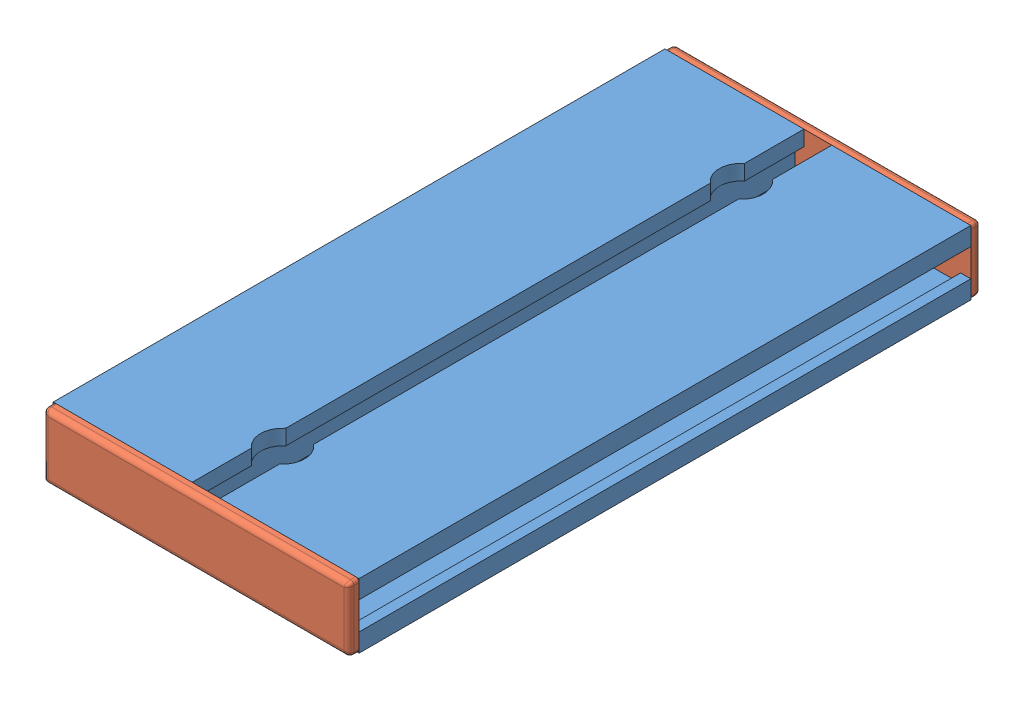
SolidWorks assembly 21.1732 FLOOR MOUNTING PLATE 45-90.SLDASM, configuration Default (file format 3800). Lengths in mm.
Overall size (90.01 19.01 186.01).
3 component instances, 2 part files, 6 mates.
Components (placement in the parent):
- 21.1732 FLOOR MOUNTING PLATE 45-90-1: 21.1732 FLOOR MOUNTING PLATE 45-90.SLDPRT [Default] at origin size (90 19 180)
- 22.1053_1 END CAP 90X19 GRAY-1: 22.1053_1 END CAP 90X19 GRAY.SLDPRT [Default] at (0 0 93) x (0 -1 0) z (0 0 -1) size (19.01 90.01 3)
- 22.1053_1 END CAP 90X19 GRAY-2: 22.1053_1 END CAP 90X19 GRAY.SLDPRT [Default] at (0 0 -93) x (0 1 0) z (0 0 1) size (19.01 90.01 3)
Mates (geometry in assembly coordinates):
- Coincident1: coincident: plane of ? through (-107.3375 0 90) normal (0 0 -1); plane of 21.1732 FLOOR MOUNTING PLATE 45-90-1 through (-18.4 -9.5 90) normal (0 0 1)
- Coincident2: coincident: plane of 21.1732 FLOOR MOUNTING PLATE 45-90-1 through (-4.1 9.5 -90) normal (0 1 0); plane of ? through (-62.3375 9.5 93) normal (0 1 0)
- Coincident3: coincident aligned: plane of 21.1732 FLOOR MOUNTING PLATE 45-90-1 through (45 -9.5 -90) normal (1 0 0); plane of ? through (-62.3375 -9.5 93) normal (1 0 0)
- Coincident4: coincident: plane of 21.1732 FLOOR MOUNTING PLATE 45-90-1 through (-18.4 -9.5 -90) normal (0 0 -1); plane of ? through (27.9544 0 -90) normal (0 0 1)
- Coincident5: coincident: plane of ? through (-17.0456 9.5 -93) normal (0 1 0); plane of 21.1732 FLOOR MOUNTING PLATE 45-90-1 through (45 9.5 -90) normal (0 1 0)
- Coincident6: coincident aligned: plane of 21.1732 FLOOR MOUNTING PLATE 45-90-1 through (45 -9.5 -90) normal (1 0 0); plane of ? through (72.9544 9.5 -93) normal (1 0 0)
